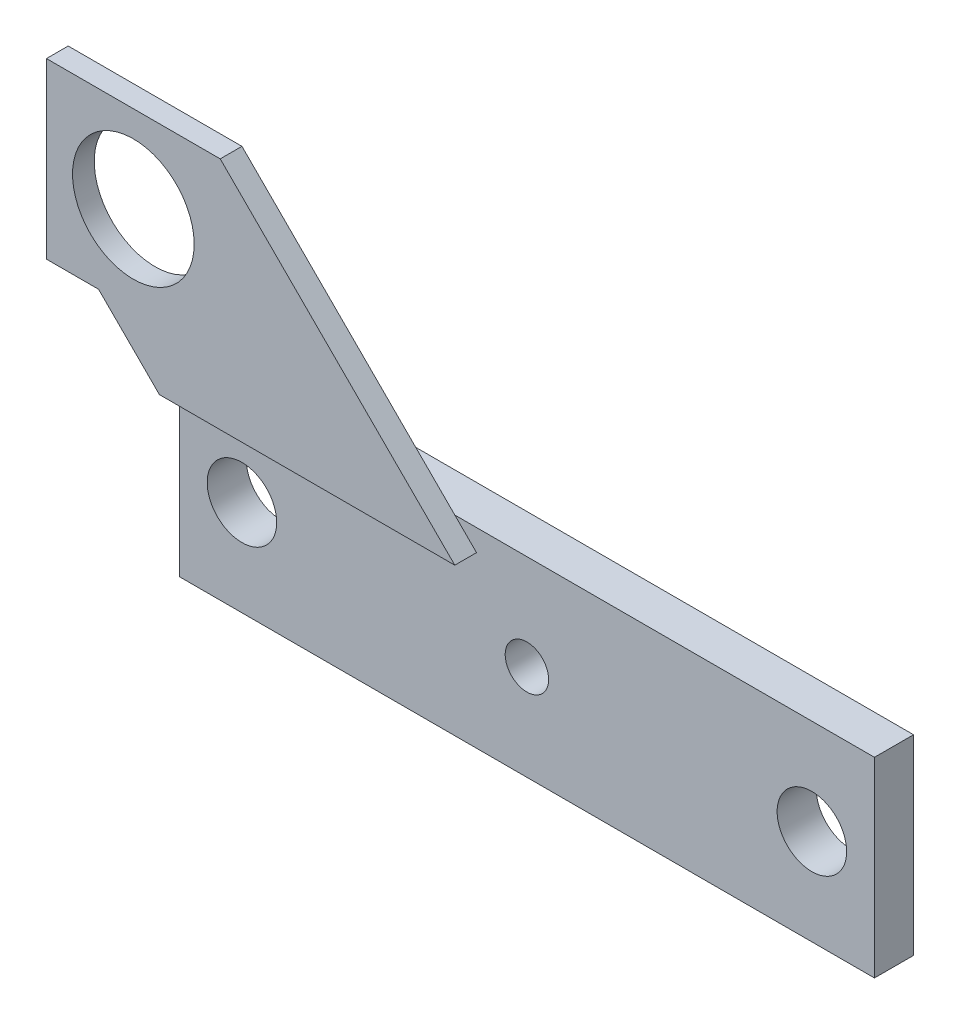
from build123d import *

# Parameters (mm, degrees)
ESQUISSE1_R        = 3.5
BOSS_EXTRU_1_DEPTH = 1.25
ESQUISSE3_W        = 40
ESQUISSE3_H        = 11
ESQUISSE3_R        = 1.25
ESQUISSE3_R_2      = 2
BOSS_EXTRU_2_DEPTH = 2.25
ESQUISSE4_R        = 3.25
ESQUISSE4_R_2      = 1.25
BOSS_EXTRU_3_DEPTH = 2


with BuildPart() as part:
    # Esquisse1 → Boss.-Extru.1 (new body)
    with BuildSketch(Plane.XY):
        Polygon((-5, 5), (5, 5), (18.5, -8.5), (1.5, -8.5), (-2, -5), (-5, -5), align=None)
        Circle(ESQUISSE1_R, mode=Mode.SUBTRACT)
    extrude(amount=BOSS_EXTRU_1_DEPTH)

    # Esquisse3 → Boss.-Extru.2 (add)
    with BuildSketch(Plane(origin=(0, 0, 0), x_dir=(-1, 0, 0), z_dir=(0, 0, -1))):
        with Locations((-21.4, -12.75)):
            Rectangle(ESQUISSE3_W, ESQUISSE3_H)
        with Locations(Location((-21.4, -12.75, 0), (0, 0, 180))):
            Circle(ESQUISSE3_R, mode=Mode.SUBTRACT)
        with Locations(Location((-5, -12.75, 0), (0, 0, 180))):
            Circle(ESQUISSE3_R_2, mode=Mode.SUBTRACT)
        with Locations(Location((-37.8, -12.75, 0), (0, 0, 180))):
            Circle(ESQUISSE3_R_2, mode=Mode.SUBTRACT)
    extrude(amount=BOSS_EXTRU_2_DEPTH)

    # Esquisse4 → Boss.-Extru.3 (add)
    with BuildSketch(Plane(origin=(0, 0, -2.25), x_dir=(-1, 0, 0), z_dir=(0, 0, -1))):
        with Locations((-21.4, -12.75)):
            Circle(ESQUISSE4_R)
        with Locations(Location((-21.4, -12.75, 0), (0, 0, 180))):
            Circle(ESQUISSE4_R_2, mode=Mode.SUBTRACT)
    extrude(amount=BOSS_EXTRU_3_DEPTH)


solid = part.part
